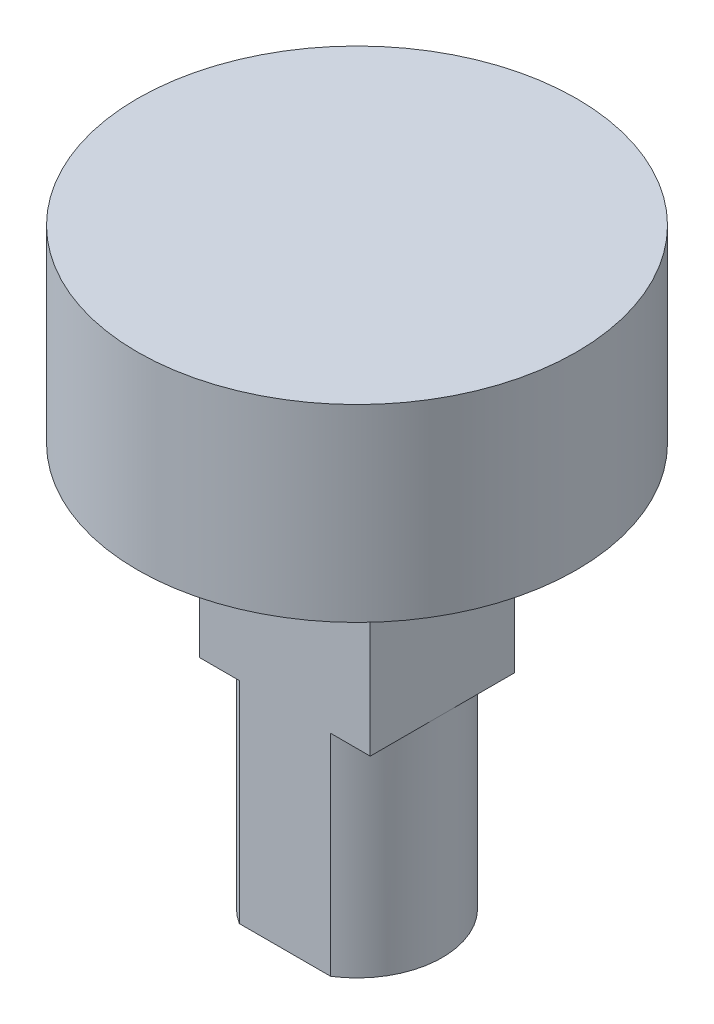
ISO-10303-21;
HEADER;
FILE_DESCRIPTION(('STEP AP214'),'2;1');
FILE_NAME('part.step','',(''),(''),'','','');
FILE_SCHEMA(('AUTOMOTIVE_DESIGN { 1 0 10303 214 1 1 1 1 }'));
ENDSEC;
DATA;
#1=APPLICATION_CONTEXT('core data for automotive mechanical design processes');
#2=APPLICATION_PROTOCOL_DEFINITION('international standard','automotive_design',2000,#1);
#3=PRODUCT_CONTEXT('',#1,'mechanical');
#4=PRODUCT('Part','Part','',(#3));
#5=PRODUCT_RELATED_PRODUCT_CATEGORY('part','',(#4));
#6=PRODUCT_DEFINITION_FORMATION('','',#4);
#7=PRODUCT_DEFINITION_CONTEXT('part definition',#1,'design');
#8=PRODUCT_DEFINITION('design','',#6,#7);
#9=PRODUCT_DEFINITION_SHAPE('','',#8);
#10=(LENGTH_UNIT() NAMED_UNIT(*) SI_UNIT(.MILLI.,.METRE.));
#11=(NAMED_UNIT(*) PLANE_ANGLE_UNIT() SI_UNIT($,.RADIAN.));
#12=(NAMED_UNIT(*) SI_UNIT($,.STERADIAN.) SOLID_ANGLE_UNIT());
#13=UNCERTAINTY_MEASURE_WITH_UNIT(LENGTH_MEASURE(1.E-05),#10,'distance_accuracy_value','');
#14=(GEOMETRIC_REPRESENTATION_CONTEXT(3) GLOBAL_UNCERTAINTY_ASSIGNED_CONTEXT((#13)) GLOBAL_UNIT_ASSIGNED_CONTEXT((#10,
#11,#12)) REPRESENTATION_CONTEXT('',''));
#15=CARTESIAN_POINT('',(0.,0.,0.));
#16=DIRECTION('',(0.,0.,1.));
#17=DIRECTION('',(1.,0.,0.));
#18=AXIS2_PLACEMENT_3D('',#15,#16,#17);
#19=CARTESIAN_POINT('',(5.969,8.89,-5.0419));
#20=DIRECTION('',(0.,-1.,0.));
#21=DIRECTION('',(0.,0.,-1.));
#22=AXIS2_PLACEMENT_3D('',#19,#20,#21);
#23=PLANE('',#22);
#24=CARTESIAN_POINT('',(0.,8.89,0.));
#25=DIRECTION('',(0.,1.,0.));
#26=DIRECTION('',(0.,0.,1.));
#27=AXIS2_PLACEMENT_3D('',#24,#25,#26);
#28=CIRCLE('',#27,5.1943);
#29=CARTESIAN_POINT('',(1.24899835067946,8.89,5.0419));
#30=VERTEX_POINT('',#29);
#31=CARTESIAN_POINT('',(1.24899835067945,8.89,-5.0419));
#32=VERTEX_POINT('',#31);
#33=EDGE_CURVE('E44',#30,#32,#28,.T.);
#34=ORIENTED_EDGE('',*,*,#33,.F.);
#35=DIRECTION('',(1.,0.,0.));
#36=VECTOR('',#35,1.);
#37=CARTESIAN_POINT('',(-5.969,8.89,5.0419));
#38=LINE('',#37,#36);
#39=CARTESIAN_POINT('',(5.969,8.89,5.0419));
#40=VERTEX_POINT('',#39);
#41=EDGE_CURVE('E127',#30,#40,#38,.T.);
#42=ORIENTED_EDGE('',*,*,#41,.T.);
#43=DIRECTION('',(0.,0.,-1.));
#44=VECTOR('',#43,1.);
#45=CARTESIAN_POINT('',(5.969,8.89,5.0419));
#46=LINE('',#45,#44);
#47=CARTESIAN_POINT('',(5.969,8.89,-5.0419));
#48=VERTEX_POINT('',#47);
#49=EDGE_CURVE('E243',#40,#48,#46,.T.);
#50=ORIENTED_EDGE('',*,*,#49,.T.);
#51=DIRECTION('',(-1.,0.,0.));
#52=VECTOR('',#51,1.);
#53=CARTESIAN_POINT('',(-5.969,8.89,-5.0419));
#54=LINE('',#53,#52);
#55=EDGE_CURVE('E247',#48,#32,#54,.T.);
#56=ORIENTED_EDGE('',*,*,#55,.T.);
#57=EDGE_LOOP('',(#34,#42,#50,#56));
#58=FACE_BOUND('',#57,.T.);
#59=ADVANCED_FACE('F33',(#58),#23,.F.);
#60=CARTESIAN_POINT('',(-1.24899835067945,8.89,-5.0419));
#61=VERTEX_POINT('',#60);
#62=CARTESIAN_POINT('',(-1.24899835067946,8.89,5.0419));
#63=VERTEX_POINT('',#62);
#64=EDGE_CURVE('E11',#61,#63,#28,.T.);
#65=ORIENTED_EDGE('',*,*,#64,.F.);
#66=CARTESIAN_POINT('',(-5.969,8.89,-5.0419));
#67=VERTEX_POINT('',#66);
#68=EDGE_CURVE('E244',#61,#67,#54,.T.);
#69=ORIENTED_EDGE('',*,*,#68,.T.);
#70=DIRECTION('',(0.,0.,1.));
#71=VECTOR('',#70,1.);
#72=CARTESIAN_POINT('',(-5.969,8.89,5.0419));
#73=LINE('',#72,#71);
#74=CARTESIAN_POINT('',(-5.969,8.89,5.0419));
#75=VERTEX_POINT('',#74);
#76=EDGE_CURVE('E120',#67,#75,#73,.T.);
#77=ORIENTED_EDGE('',*,*,#76,.T.);
#78=EDGE_CURVE('E116',#75,#63,#38,.T.);
#79=ORIENTED_EDGE('',*,*,#78,.T.);
#80=EDGE_LOOP('',(#65,#69,#77,#79));
#81=FACE_BOUND('',#80,.T.);
#82=ADVANCED_FACE('F118',(#81),#23,.F.);
#83=CARTESIAN_POINT('',(5.969,0.,-5.0419));
#84=DIRECTION('',(0.,-1.,0.));
#85=DIRECTION('',(0.,0.,-1.));
#86=AXIS2_PLACEMENT_3D('',#83,#84,#85);
#87=PLANE('',#86);
#88=CARTESIAN_POINT('',(0.,0.,0.));
#89=DIRECTION('',(0.,-1.,0.));
#90=DIRECTION('',(0.,0.,-1.));
#91=AXIS2_PLACEMENT_3D('',#88,#89,#90);
#92=CIRCLE('',#91,5.969);
#93=CARTESIAN_POINT('',(3.19502822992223,0.,-5.0419));
#94=VERTEX_POINT('',#93);
#95=CARTESIAN_POINT('',(5.969,0.,0.));
#96=VERTEX_POINT('',#95);
#97=EDGE_CURVE('E168',#94,#96,#92,.T.);
#98=ORIENTED_EDGE('',*,*,#97,.F.);
#99=DIRECTION('',(-1.,0.,0.));
#100=VECTOR('',#99,1.);
#101=CARTESIAN_POINT('',(-5.969,0.,-5.0419));
#102=LINE('',#101,#100);
#103=CARTESIAN_POINT('',(5.969,0.,-5.0419));
#104=VERTEX_POINT('',#103);
#105=EDGE_CURVE('E212',#104,#94,#102,.T.);
#106=ORIENTED_EDGE('',*,*,#105,.F.);
#107=DIRECTION('',(0.,0.,-1.));
#108=VECTOR('',#107,1.);
#109=CARTESIAN_POINT('',(5.969,0.,5.0419));
#110=LINE('',#109,#108);
#111=EDGE_CURVE('E193',#96,#104,#110,.T.);
#112=ORIENTED_EDGE('',*,*,#111,.F.);
#113=EDGE_LOOP('',(#98,#106,#112));
#114=FACE_BOUND('',#113,.T.);
#115=ADVANCED_FACE('F240',(#114),#87,.T.);
#116=CARTESIAN_POINT('',(3.19502822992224,0.,5.0419));
#117=VERTEX_POINT('',#116);
#118=EDGE_CURVE('E42',#96,#117,#92,.T.);
#119=ORIENTED_EDGE('',*,*,#118,.F.);
#120=CARTESIAN_POINT('',(5.969,0.,5.0419));
#121=VERTEX_POINT('',#120);
#122=EDGE_CURVE('E195',#121,#96,#110,.T.);
#123=ORIENTED_EDGE('',*,*,#122,.F.);
#124=DIRECTION('',(1.,0.,0.));
#125=VECTOR('',#124,1.);
#126=CARTESIAN_POINT('',(-5.969,0.,5.0419));
#127=LINE('',#126,#125);
#128=EDGE_CURVE('E216',#117,#121,#127,.T.);
#129=ORIENTED_EDGE('',*,*,#128,.F.);
#130=EDGE_LOOP('',(#119,#123,#129));
#131=FACE_BOUND('',#130,.T.);
#132=ADVANCED_FACE('F238',(#131),#87,.T.);
#133=CARTESIAN_POINT('',(0.,0.,0.));
#134=DIRECTION('',(0.,-1.,0.));
#135=DIRECTION('',(0.,0.,1.));
#136=AXIS2_PLACEMENT_3D('',#133,#134,#135);
#137=CIRCLE('',#136,5.969);
#138=CARTESIAN_POINT('',(-3.19502822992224,0.,5.0419));
#139=VERTEX_POINT('',#138);
#140=CARTESIAN_POINT('',(-5.969,0.,0.));
#141=VERTEX_POINT('',#140);
#142=EDGE_CURVE('E152',#139,#141,#137,.T.);
#143=ORIENTED_EDGE('',*,*,#142,.F.);
#144=CARTESIAN_POINT('',(-5.969,0.,5.0419));
#145=VERTEX_POINT('',#144);
#146=EDGE_CURVE('E218',#145,#139,#127,.T.);
#147=ORIENTED_EDGE('',*,*,#146,.F.);
#148=DIRECTION('',(0.,0.,1.));
#149=VECTOR('',#148,1.);
#150=CARTESIAN_POINT('',(-5.969,0.,5.0419));
#151=LINE('',#150,#149);
#152=EDGE_CURVE('E215',#141,#145,#151,.T.);
#153=ORIENTED_EDGE('',*,*,#152,.F.);
#154=EDGE_LOOP('',(#143,#147,#153));
#155=FACE_BOUND('',#154,.T.);
#156=ADVANCED_FACE('F260',(#155),#87,.T.);
#157=CARTESIAN_POINT('',(5.969,8.89,5.0419));
#158=DIRECTION('',(-1.,0.,0.));
#159=DIRECTION('',(0.,0.,1.));
#160=AXIS2_PLACEMENT_3D('',#157,#158,#159);
#161=PLANE('',#160);
#162=ORIENTED_EDGE('',*,*,#122,.T.);
#163=ORIENTED_EDGE('',*,*,#111,.T.);
#164=DIRECTION('',(0.,-1.,0.));
#165=VECTOR('',#164,1.);
#166=CARTESIAN_POINT('',(5.969,8.89,-5.0419));
#167=LINE('',#166,#165);
#168=EDGE_CURVE('E229',#48,#104,#167,.T.);
#169=ORIENTED_EDGE('',*,*,#168,.F.);
#170=ORIENTED_EDGE('',*,*,#49,.F.);
#171=DIRECTION('',(0.,-1.,0.));
#172=VECTOR('',#171,1.);
#173=CARTESIAN_POINT('',(5.969,8.89,5.0419));
#174=LINE('',#173,#172);
#175=EDGE_CURVE('E124',#40,#121,#174,.T.);
#176=ORIENTED_EDGE('',*,*,#175,.T.);
#177=EDGE_LOOP('',(#162,#163,#169,#170,#176));
#178=FACE_BOUND('',#177,.T.);
#179=ADVANCED_FACE('F35',(#178),#161,.F.);
#180=CARTESIAN_POINT('',(-5.969,8.89,-5.0419));
#181=DIRECTION('',(0.,0.,1.));
#182=DIRECTION('',(1.,0.,0.));
#183=AXIS2_PLACEMENT_3D('',#180,#181,#182);
#184=PLANE('',#183);
#185=ORIENTED_EDGE('',*,*,#105,.T.);
#186=DIRECTION('',(0.,1.,0.));
#187=VECTOR('',#186,1.);
#188=CARTESIAN_POINT('',(3.19502822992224,-14.732,-5.0419));
#189=LINE('',#188,#187);
#190=CARTESIAN_POINT('',(3.19502822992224,-14.732,-5.0419));
#191=VERTEX_POINT('',#190);
#192=EDGE_CURVE('E158',#191,#94,#189,.T.);
#193=ORIENTED_EDGE('',*,*,#192,.F.);
#194=DIRECTION('',(1.,0.,0.));
#195=VECTOR('',#194,1.);
#196=CARTESIAN_POINT('',(-3.19502822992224,-14.732,-5.0419));
#197=LINE('',#196,#195);
#198=CARTESIAN_POINT('',(-3.19502822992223,-14.732,-5.0419));
#199=VERTEX_POINT('',#198);
#200=EDGE_CURVE('E156',#199,#191,#197,.T.);
#201=ORIENTED_EDGE('',*,*,#200,.F.);
#202=DIRECTION('',(0.,1.,0.));
#203=VECTOR('',#202,1.);
#204=CARTESIAN_POINT('',(-3.19502822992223,-14.732,-5.0419));
#205=LINE('',#204,#203);
#206=CARTESIAN_POINT('',(-3.19502822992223,0.,-5.0419));
#207=VERTEX_POINT('',#206);
#208=EDGE_CURVE('E174',#199,#207,#205,.T.);
#209=ORIENTED_EDGE('',*,*,#208,.T.);
#210=CARTESIAN_POINT('',(-5.969,0.,-5.0419));
#211=VERTEX_POINT('',#210);
#212=EDGE_CURVE('E202',#207,#211,#102,.T.);
#213=ORIENTED_EDGE('',*,*,#212,.T.);
#214=DIRECTION('',(0.,-1.,0.));
#215=VECTOR('',#214,1.);
#216=CARTESIAN_POINT('',(-5.969,8.89,-5.0419));
#217=LINE('',#216,#215);
#218=EDGE_CURVE('E227',#67,#211,#217,.T.);
#219=ORIENTED_EDGE('',*,*,#218,.F.);
#220=ORIENTED_EDGE('',*,*,#68,.F.);
#221=EDGE_CURVE('E245',#32,#61,#54,.T.);
#222=ORIENTED_EDGE('',*,*,#221,.F.);
#223=ORIENTED_EDGE('',*,*,#55,.F.);
#224=ORIENTED_EDGE('',*,*,#168,.T.);
#225=EDGE_LOOP('',(#185,#193,#201,#209,#213,#219,#220,#222,#223,#224));
#226=FACE_BOUND('',#225,.T.);
#227=ADVANCED_FACE('F265',(#226),#184,.F.);
#228=CARTESIAN_POINT('',(-5.969,8.89,5.0419));
#229=DIRECTION('',(1.,0.,0.));
#230=DIRECTION('',(0.,0.,-1.));
#231=AXIS2_PLACEMENT_3D('',#228,#229,#230);
#232=PLANE('',#231);
#233=EDGE_CURVE('E207',#211,#141,#151,.T.);
#234=ORIENTED_EDGE('',*,*,#233,.T.);
#235=ORIENTED_EDGE('',*,*,#152,.T.);
#236=DIRECTION('',(0.,-1.,0.));
#237=VECTOR('',#236,1.);
#238=CARTESIAN_POINT('',(-5.969,8.89,5.0419));
#239=LINE('',#238,#237);
#240=EDGE_CURVE('E225',#75,#145,#239,.T.);
#241=ORIENTED_EDGE('',*,*,#240,.F.);
#242=ORIENTED_EDGE('',*,*,#76,.F.);
#243=ORIENTED_EDGE('',*,*,#218,.T.);
#244=EDGE_LOOP('',(#234,#235,#241,#242,#243));
#245=FACE_BOUND('',#244,.T.);
#246=ADVANCED_FACE('F263',(#245),#232,.F.);
#247=CARTESIAN_POINT('',(-5.969,8.89,5.0419));
#248=DIRECTION('',(0.,0.,-1.));
#249=DIRECTION('',(-1.,0.,0.));
#250=AXIS2_PLACEMENT_3D('',#247,#248,#249);
#251=PLANE('',#250);
#252=ORIENTED_EDGE('',*,*,#146,.T.);
#253=DIRECTION('',(0.,1.,0.));
#254=VECTOR('',#253,1.);
#255=CARTESIAN_POINT('',(-3.19502822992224,-14.732,5.0419));
#256=LINE('',#255,#254);
#257=CARTESIAN_POINT('',(-3.19502822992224,-14.732,5.0419));
#258=VERTEX_POINT('',#257);
#259=EDGE_CURVE('E179',#258,#139,#256,.T.);
#260=ORIENTED_EDGE('',*,*,#259,.F.);
#261=DIRECTION('',(-1.,0.,0.));
#262=VECTOR('',#261,1.);
#263=CARTESIAN_POINT('',(-3.19502822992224,-14.732,5.0419));
#264=LINE('',#263,#262);
#265=CARTESIAN_POINT('',(3.19502822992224,-14.732,5.0419));
#266=VERTEX_POINT('',#265);
#267=EDGE_CURVE('E151',#266,#258,#264,.T.);
#268=ORIENTED_EDGE('',*,*,#267,.F.);
#269=DIRECTION('',(0.,1.,0.));
#270=VECTOR('',#269,1.);
#271=CARTESIAN_POINT('',(3.19502822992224,-14.732,5.0419));
#272=LINE('',#271,#270);
#273=EDGE_CURVE('E184',#266,#117,#272,.T.);
#274=ORIENTED_EDGE('',*,*,#273,.T.);
#275=ORIENTED_EDGE('',*,*,#128,.T.);
#276=ORIENTED_EDGE('',*,*,#175,.F.);
#277=ORIENTED_EDGE('',*,*,#41,.F.);
#278=EDGE_CURVE('E125',#63,#30,#38,.T.);
#279=ORIENTED_EDGE('',*,*,#278,.F.);
#280=ORIENTED_EDGE('',*,*,#78,.F.);
#281=ORIENTED_EDGE('',*,*,#240,.T.);
#282=EDGE_LOOP('',(#252,#260,#268,#274,#275,#276,#277,#279,#280,#281));
#283=FACE_BOUND('',#282,.T.);
#284=ADVANCED_FACE('F131',(#283),#251,.F.);
#285=EDGE_CURVE('E231',#141,#207,#137,.T.);
#286=ORIENTED_EDGE('',*,*,#285,.F.);
#287=ORIENTED_EDGE('',*,*,#233,.F.);
#288=ORIENTED_EDGE('',*,*,#212,.F.);
#289=EDGE_LOOP('',(#286,#287,#288));
#290=FACE_BOUND('',#289,.T.);
#291=ADVANCED_FACE('F256',(#290),#87,.T.);
#292=CARTESIAN_POINT('',(0.,-14.732,0.));
#293=DIRECTION('',(0.,1.,0.));
#294=DIRECTION('',(0.,0.,1.));
#295=AXIS2_PLACEMENT_3D('',#292,#293,#294);
#296=CYLINDRICAL_SURFACE('',#295,5.969);
#297=ORIENTED_EDGE('',*,*,#97,.T.);
#298=ORIENTED_EDGE('',*,*,#118,.T.);
#299=ORIENTED_EDGE('',*,*,#273,.F.);
#300=CARTESIAN_POINT('',(0.,-14.732,0.));
#301=DIRECTION('',(0.,-1.,0.));
#302=DIRECTION('',(0.,0.,-1.));
#303=AXIS2_PLACEMENT_3D('',#300,#301,#302);
#304=CIRCLE('',#303,5.969);
#305=EDGE_CURVE('E148',#191,#266,#304,.T.);
#306=ORIENTED_EDGE('',*,*,#305,.F.);
#307=ORIENTED_EDGE('',*,*,#192,.T.);
#308=EDGE_LOOP('',(#297,#298,#299,#306,#307));
#309=FACE_BOUND('',#308,.T.);
#310=ADVANCED_FACE('F235',(#309),#296,.T.);
#311=CARTESIAN_POINT('',(0.,-14.732,0.));
#312=DIRECTION('',(0.,1.,0.));
#313=DIRECTION('',(0.,0.,1.));
#314=AXIS2_PLACEMENT_3D('',#311,#312,#313);
#315=CYLINDRICAL_SURFACE('',#314,5.969);
#316=ORIENTED_EDGE('',*,*,#142,.T.);
#317=ORIENTED_EDGE('',*,*,#285,.T.);
#318=ORIENTED_EDGE('',*,*,#208,.F.);
#319=CARTESIAN_POINT('',(0.,-14.732,0.));
#320=DIRECTION('',(0.,-1.,0.));
#321=DIRECTION('',(0.,0.,1.));
#322=AXIS2_PLACEMENT_3D('',#319,#320,#321);
#323=CIRCLE('',#322,5.969);
#324=EDGE_CURVE('E154',#258,#199,#323,.T.);
#325=ORIENTED_EDGE('',*,*,#324,.F.);
#326=ORIENTED_EDGE('',*,*,#259,.T.);
#327=EDGE_LOOP('',(#316,#317,#318,#325,#326));
#328=FACE_BOUND('',#327,.T.);
#329=ADVANCED_FACE('F275',(#328),#315,.T.);
#330=CARTESIAN_POINT('',(0.,-14.732,0.));
#331=DIRECTION('',(0.,-1.,0.));
#332=DIRECTION('',(0.,0.,-1.));
#333=AXIS2_PLACEMENT_3D('',#330,#331,#332);
#334=PLANE('',#333);
#335=ORIENTED_EDGE('',*,*,#305,.T.);
#336=ORIENTED_EDGE('',*,*,#267,.T.);
#337=ORIENTED_EDGE('',*,*,#324,.T.);
#338=ORIENTED_EDGE('',*,*,#200,.T.);
#339=EDGE_LOOP('',(#335,#336,#337,#338));
#340=FACE_BOUND('',#339,.T.);
#341=ADVANCED_FACE('F272',(#340),#334,.T.);
#342=CARTESIAN_POINT('',(0.,8.89,0.));
#343=DIRECTION('',(0.,1.,0.));
#344=DIRECTION('',(0.,0.,1.));
#345=AXIS2_PLACEMENT_3D('',#342,#343,#344);
#346=PLANE('',#345);
#347=EDGE_CURVE('E45',#32,#61,#28,.T.);
#348=ORIENTED_EDGE('',*,*,#347,.F.);
#349=ORIENTED_EDGE('',*,*,#221,.T.);
#350=EDGE_LOOP('',(#348,#349));
#351=FACE_BOUND('',#350,.T.);
#352=ADVANCED_FACE('F281',(#351),#346,.F.);
#353=EDGE_CURVE('E135',#63,#30,#28,.T.);
#354=ORIENTED_EDGE('',*,*,#353,.F.);
#355=ORIENTED_EDGE('',*,*,#278,.T.);
#356=EDGE_LOOP('',(#354,#355));
#357=FACE_BOUND('',#356,.T.);
#358=ADVANCED_FACE('F136',(#357),#346,.F.);
#359=CARTESIAN_POINT('',(0.,13.462,0.));
#360=DIRECTION('',(0.,-1.,0.));
#361=DIRECTION('',(0.,0.,-1.));
#362=AXIS2_PLACEMENT_3D('',#359,#360,#361);
#363=CYLINDRICAL_SURFACE('',#362,5.1943);
#364=CARTESIAN_POINT('',(0.,13.462,0.));
#365=DIRECTION('',(0.,1.,0.));
#366=DIRECTION('',(0.,0.,1.));
#367=AXIS2_PLACEMENT_3D('',#364,#365,#366);
#368=CIRCLE('',#367,5.1943);
#369=CARTESIAN_POINT('',(0.,13.462,5.1943));
#370=VERTEX_POINT('',#369);
#371=EDGE_CURVE('E144',#370,#370,#368,.T.);
#372=ORIENTED_EDGE('',*,*,#371,.F.);
#373=EDGE_LOOP('',(#372));
#374=FACE_BOUND('',#373,.T.);
#375=ORIENTED_EDGE('',*,*,#33,.T.);
#376=ORIENTED_EDGE('',*,*,#347,.T.);
#377=ORIENTED_EDGE('',*,*,#64,.T.);
#378=ORIENTED_EDGE('',*,*,#353,.T.);
#379=EDGE_LOOP('',(#375,#376,#377,#378));
#380=FACE_BOUND('',#379,.T.);
#381=ADVANCED_FACE('F140',(#374,#380),#363,.T.);
#382=CARTESIAN_POINT('',(0.,13.462,0.));
#383=DIRECTION('',(0.,1.,0.));
#384=DIRECTION('',(0.,0.,1.));
#385=AXIS2_PLACEMENT_3D('',#382,#383,#384);
#386=PLANE('',#385);
#387=CARTESIAN_POINT('',(0.,13.462,0.));
#388=DIRECTION('',(0.,1.,0.));
#389=DIRECTION('',(0.,0.,1.));
#390=AXIS2_PLACEMENT_3D('',#387,#388,#389);
#391=CIRCLE('',#390,15.367);
#392=CARTESIAN_POINT('',(0.,13.462,-15.367));
#393=VERTEX_POINT('',#392);
#394=EDGE_CURVE('E304',#393,#393,#391,.T.);
#395=ORIENTED_EDGE('',*,*,#394,.F.);
#396=EDGE_LOOP('',(#395));
#397=FACE_BOUND('',#396,.T.);
#398=ORIENTED_EDGE('',*,*,#371,.T.);
#399=EDGE_LOOP('',(#398));
#400=FACE_BOUND('',#399,.T.);
#401=ADVANCED_FACE('F286',(#397,#400),#386,.F.);
#402=CARTESIAN_POINT('',(0.,26.67,0.));
#403=DIRECTION('',(0.,-1.,0.));
#404=DIRECTION('',(0.,0.,-1.));
#405=AXIS2_PLACEMENT_3D('',#402,#403,#404);
#406=CYLINDRICAL_SURFACE('',#405,15.367);
#407=CARTESIAN_POINT('',(0.,26.67,0.));
#408=DIRECTION('',(0.,1.,0.));
#409=DIRECTION('',(0.,0.,1.));
#410=AXIS2_PLACEMENT_3D('',#407,#408,#409);
#411=CIRCLE('',#410,15.367);
#412=CARTESIAN_POINT('',(0.,26.67,-15.367));
#413=VERTEX_POINT('',#412);
#414=EDGE_CURVE('E138',#413,#413,#411,.T.);
#415=CARTESIAN_POINT('',(0.,26.67,-15.367));
#416=CARTESIAN_POINT('',(0.,26.5324166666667,-15.367));
#417=CARTESIAN_POINT('',(0.,26.3948333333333,-15.367));
#418=CARTESIAN_POINT('',(0.,26.1196666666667,-15.367));
#419=CARTESIAN_POINT('',(0.,25.9820833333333,-15.367));
#420=CARTESIAN_POINT('',(0.,25.7069166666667,-15.367));
#421=CARTESIAN_POINT('',(0.,25.5693333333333,-15.367));
#422=CARTESIAN_POINT('',(0.,25.2941666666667,-15.367));
#423=CARTESIAN_POINT('',(0.,25.1565833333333,-15.367));
#424=CARTESIAN_POINT('',(0.,24.8814166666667,-15.367));
#425=CARTESIAN_POINT('',(0.,24.7438333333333,-15.367));
#426=CARTESIAN_POINT('',(0.,24.4686666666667,-15.367));
#427=CARTESIAN_POINT('',(0.,24.3310833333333,-15.367));
#428=CARTESIAN_POINT('',(0.,24.0559166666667,-15.367));
#429=CARTESIAN_POINT('',(0.,23.9183333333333,-15.367));
#430=CARTESIAN_POINT('',(0.,23.6431666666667,-15.367));
#431=CARTESIAN_POINT('',(0.,23.5055833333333,-15.367));
#432=CARTESIAN_POINT('',(0.,23.2304166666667,-15.367));
#433=CARTESIAN_POINT('',(0.,23.0928333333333,-15.367));
#434=CARTESIAN_POINT('',(0.,22.8176666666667,-15.367));
#435=CARTESIAN_POINT('',(0.,22.6800833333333,-15.367));
#436=CARTESIAN_POINT('',(0.,22.4049166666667,-15.367));
#437=CARTESIAN_POINT('',(0.,22.2673333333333,-15.367));
#438=CARTESIAN_POINT('',(0.,21.9921666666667,-15.367));
#439=CARTESIAN_POINT('',(0.,21.8545833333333,-15.367));
#440=CARTESIAN_POINT('',(0.,21.5794166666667,-15.367));
#441=CARTESIAN_POINT('',(0.,21.4418333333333,-15.367));
#442=CARTESIAN_POINT('',(0.,21.1666666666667,-15.367));
#443=CARTESIAN_POINT('',(0.,21.0290833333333,-15.367));
#444=CARTESIAN_POINT('',(0.,20.7539166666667,-15.367));
#445=CARTESIAN_POINT('',(0.,20.6163333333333,-15.367));
#446=CARTESIAN_POINT('',(0.,20.3411666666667,-15.367));
#447=CARTESIAN_POINT('',(0.,20.2035833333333,-15.367));
#448=CARTESIAN_POINT('',(0.,19.9284166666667,-15.367));
#449=CARTESIAN_POINT('',(0.,19.7908333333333,-15.367));
#450=CARTESIAN_POINT('',(0.,19.5156666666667,-15.367));
#451=CARTESIAN_POINT('',(0.,19.3780833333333,-15.367));
#452=CARTESIAN_POINT('',(0.,19.1029166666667,-15.367));
#453=CARTESIAN_POINT('',(0.,18.9653333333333,-15.367));
#454=CARTESIAN_POINT('',(0.,18.6901666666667,-15.367));
#455=CARTESIAN_POINT('',(0.,18.5525833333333,-15.367));
#456=CARTESIAN_POINT('',(0.,18.2774166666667,-15.367));
#457=CARTESIAN_POINT('',(0.,18.1398333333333,-15.367));
#458=CARTESIAN_POINT('',(0.,17.8646666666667,-15.367));
#459=CARTESIAN_POINT('',(0.,17.7270833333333,-15.367));
#460=CARTESIAN_POINT('',(0.,17.4519166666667,-15.367));
#461=CARTESIAN_POINT('',(0.,17.3143333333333,-15.367));
#462=CARTESIAN_POINT('',(0.,17.0391666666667,-15.367));
#463=CARTESIAN_POINT('',(0.,16.9015833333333,-15.367));
#464=CARTESIAN_POINT('',(0.,16.6264166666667,-15.367));
#465=CARTESIAN_POINT('',(0.,16.4888333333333,-15.367));
#466=CARTESIAN_POINT('',(0.,16.2136666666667,-15.367));
#467=CARTESIAN_POINT('',(0.,16.0760833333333,-15.367));
#468=CARTESIAN_POINT('',(0.,15.8009166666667,-15.367));
#469=CARTESIAN_POINT('',(0.,15.6633333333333,-15.367));
#470=CARTESIAN_POINT('',(0.,15.3881666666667,-15.367));
#471=CARTESIAN_POINT('',(0.,15.2505833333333,-15.367));
#472=CARTESIAN_POINT('',(0.,14.9754166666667,-15.367));
#473=CARTESIAN_POINT('',(0.,14.8378333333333,-15.367));
#474=CARTESIAN_POINT('',(0.,14.5626666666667,-15.367));
#475=CARTESIAN_POINT('',(0.,14.4250833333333,-15.367));
#476=CARTESIAN_POINT('',(0.,14.1499166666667,-15.367));
#477=CARTESIAN_POINT('',(0.,14.0123333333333,-15.367));
#478=CARTESIAN_POINT('',(0.,13.7371666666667,-15.367));
#479=CARTESIAN_POINT('',(0.,13.5995833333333,-15.367));
#480=CARTESIAN_POINT('',(0.,13.462,-15.367));
#481=B_SPLINE_CURVE_WITH_KNOTS('',3,(#415,#416,#417,#418,#419,#420,#421,#422,#423,#424,#425,
#426,#427,#428,#429,#430,#431,#432,#433,#434,#435,#436,#437,#438,#439,#440,#441,#442,#443,#444,
#445,#446,#447,#448,#449,#450,#451,#452,#453,#454,#455,#456,#457,#458,#459,#460,#461,#462,#463,
#464,#465,#466,#467,#468,#469,#470,#471,#472,#473,#474,#475,#476,#477,#478,#479,#480),
.UNSPECIFIED.,.F.,.F.,(4,2,2,2,2,2,2,2,2,2,2,2,2,2,2,2,2,2,2,2,2,2,2,2,2,2,2,2,2,2,2,2,4),(0.,
0.41275,0.8255,1.23825,1.651,2.06375,2.4765,2.88925,3.302,3.71475,4.1275,4.54025,4.953,5.36575,
5.7785,6.19125,6.604,7.01675,7.4295,7.84225,8.255,8.66775,9.0805,9.49325,9.906,10.31875,10.7315,
11.14425,11.557,11.96975,12.3825,12.79525,13.208),.UNSPECIFIED.);
#482=EDGE_CURVE('BSEAM290',#413,#393,#481,.T.);
#483=ORIENTED_EDGE('',*,*,#414,.F.);
#484=ORIENTED_EDGE('',*,*,#394,.T.);
#485=ORIENTED_EDGE('',*,*,#482,.T.);
#486=ORIENTED_EDGE('',*,*,#482,.F.);
#487=EDGE_LOOP('',(#483,#485,#484,#486));
#488=FACE_BOUND('',#487,.T.);
#489=ADVANCED_FACE('F290',(#488),#406,.T.);
#490=CARTESIAN_POINT('',(0.,26.67,0.));
#491=DIRECTION('',(0.,1.,0.));
#492=DIRECTION('',(0.,0.,1.));
#493=AXIS2_PLACEMENT_3D('',#490,#491,#492);
#494=PLANE('',#493);
#495=ORIENTED_EDGE('',*,*,#414,.T.);
#496=EDGE_LOOP('',(#495));
#497=FACE_BOUND('',#496,.T.);
#498=ADVANCED_FACE('F293',(#497),#494,.T.);
#499=CLOSED_SHELL('',(#59,#82,#115,#132,#156,#179,#227,#246,#284,#291,#310,#329,#341,#352,#358,
#381,#401,#489,#498));
#500=MANIFOLD_SOLID_BREP('B2',#499);
#501=ADVANCED_BREP_SHAPE_REPRESENTATION('',(#18,#500),#14);
#502=SHAPE_DEFINITION_REPRESENTATION(#9,#501);
ENDSEC;
END-ISO-10303-21;
